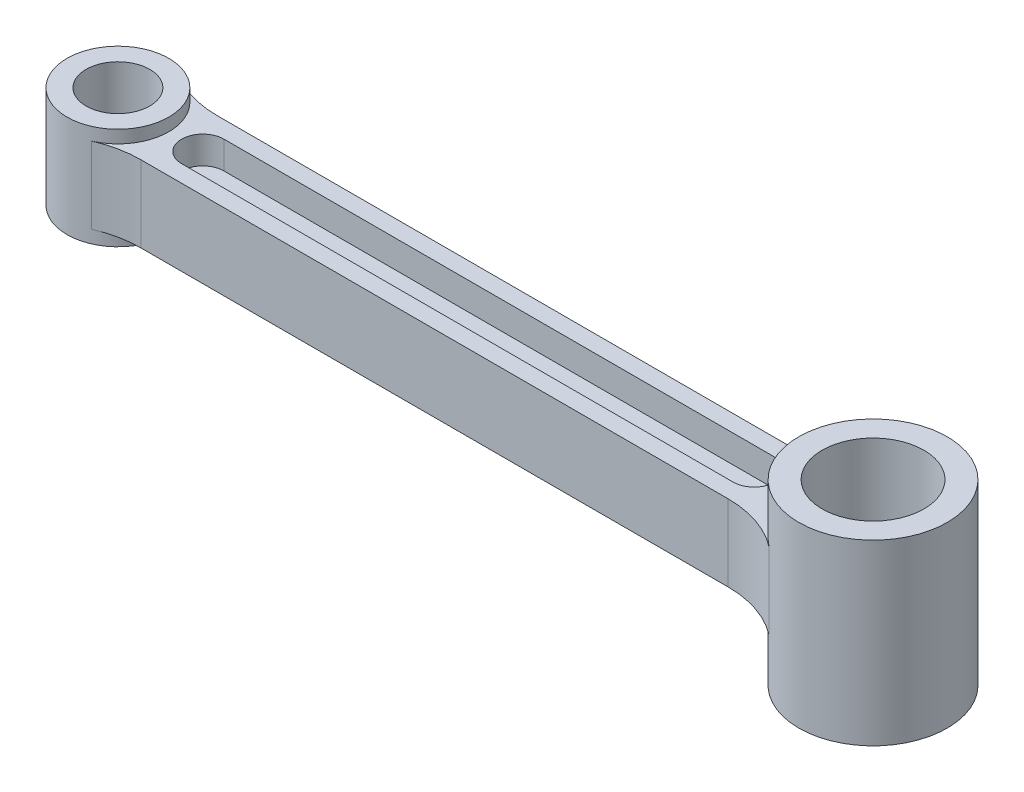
ISO-10303-21;
HEADER;
FILE_DESCRIPTION(('STEP AP214'),'2;1');
FILE_NAME('part.step','',(''),(''),'','','');
FILE_SCHEMA(('AUTOMOTIVE_DESIGN { 1 0 10303 214 1 1 1 1 }'));
ENDSEC;
DATA;
#1=APPLICATION_CONTEXT('core data for automotive mechanical design processes');
#2=APPLICATION_PROTOCOL_DEFINITION('international standard','automotive_design',2000,#1);
#3=PRODUCT_CONTEXT('',#1,'mechanical');
#4=PRODUCT('Part','Part','',(#3));
#5=PRODUCT_RELATED_PRODUCT_CATEGORY('part','',(#4));
#6=PRODUCT_DEFINITION_FORMATION('','',#4);
#7=PRODUCT_DEFINITION_CONTEXT('part definition',#1,'design');
#8=PRODUCT_DEFINITION('design','',#6,#7);
#9=PRODUCT_DEFINITION_SHAPE('','',#8);
#10=(LENGTH_UNIT() NAMED_UNIT(*) SI_UNIT(.MILLI.,.METRE.));
#11=(NAMED_UNIT(*) PLANE_ANGLE_UNIT() SI_UNIT($,.RADIAN.));
#12=(NAMED_UNIT(*) SI_UNIT($,.STERADIAN.) SOLID_ANGLE_UNIT());
#13=UNCERTAINTY_MEASURE_WITH_UNIT(LENGTH_MEASURE(1.E-05),#10,'distance_accuracy_value','');
#14=(GEOMETRIC_REPRESENTATION_CONTEXT(3) GLOBAL_UNCERTAINTY_ASSIGNED_CONTEXT((#13)) GLOBAL_UNIT_ASSIGNED_CONTEXT((#10,
#11,#12)) REPRESENTATION_CONTEXT('',''));
#15=CARTESIAN_POINT('',(0.,0.,0.));
#16=DIRECTION('',(0.,0.,1.));
#17=DIRECTION('',(1.,0.,0.));
#18=AXIS2_PLACEMENT_3D('',#15,#16,#17);
#19=CARTESIAN_POINT('',(-72.0684088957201,-9.,0.));
#20=DIRECTION('',(0.,1.,0.));
#21=DIRECTION('',(0.,0.,1.));
#22=AXIS2_PLACEMENT_3D('',#19,#20,#21);
#23=PLANE('',#22);
#24=CARTESIAN_POINT('',(178.,-9.,0.));
#25=DIRECTION('',(0.,1.,0.));
#26=DIRECTION('',(0.,0.,1.));
#27=AXIS2_PLACEMENT_3D('',#24,#25,#26);
#28=CIRCLE('',#27,17.5);
#29=CARTESIAN_POINT('',(167.388481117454,-9.,-13.9156626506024));
#30=VERTEX_POINT('',#29);
#31=CARTESIAN_POINT('',(167.388481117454,-9.,13.9156626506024));
#32=VERTEX_POINT('',#31);
#33=EDGE_CURVE('E232',#30,#32,#28,.T.);
#34=ORIENTED_EDGE('',*,*,#33,.T.);
#35=CARTESIAN_POINT('',(152.835540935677,-9.,33.));
#36=DIRECTION('',(0.,1.,0.));
#37=DIRECTION('',(0.,0.,1.));
#38=AXIS2_PLACEMENT_3D('',#35,#36,#37);
#39=CIRCLE('',#38,24.);
#40=CARTESIAN_POINT('',(152.835540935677,-9.,9.));
#41=VERTEX_POINT('',#40);
#42=EDGE_CURVE('E40',#32,#41,#39,.T.);
#43=ORIENTED_EDGE('',*,*,#42,.T.);
#44=DIRECTION('',(1.,0.,0.));
#45=VECTOR('',#44,1.);
#46=CARTESIAN_POINT('',(-72.0684088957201,-9.,9.));
#47=LINE('',#46,#45);
#48=CARTESIAN_POINT('',(14.3874945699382,-9.,9.));
#49=VERTEX_POINT('',#48);
#50=EDGE_CURVE('E239',#49,#41,#47,.T.);
#51=ORIENTED_EDGE('',*,*,#50,.F.);
#52=CARTESIAN_POINT('',(14.3874945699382,-9.,33.));
#53=DIRECTION('',(0.,1.,0.));
#54=DIRECTION('',(0.,0.,1.));
#55=AXIS2_PLACEMENT_3D('',#52,#53,#54);
#56=CIRCLE('',#55,24.);
#57=CARTESIAN_POINT('',(4.79583152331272,-9.,11.));
#58=VERTEX_POINT('',#57);
#59=EDGE_CURVE('E279',#49,#58,#56,.T.);
#60=ORIENTED_EDGE('',*,*,#59,.T.);
#61=CARTESIAN_POINT('',(0.,-9.,0.));
#62=DIRECTION('',(0.,1.,0.));
#63=DIRECTION('',(0.,0.,1.));
#64=AXIS2_PLACEMENT_3D('',#61,#62,#63);
#65=CIRCLE('',#64,12.);
#66=CARTESIAN_POINT('',(4.79583152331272,-9.,-11.));
#67=VERTEX_POINT('',#66);
#68=EDGE_CURVE('E237',#58,#67,#65,.T.);
#69=ORIENTED_EDGE('',*,*,#68,.T.);
#70=CARTESIAN_POINT('',(14.3874945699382,-9.,-33.));
#71=DIRECTION('',(0.,1.,0.));
#72=DIRECTION('',(0.,0.,1.));
#73=AXIS2_PLACEMENT_3D('',#70,#71,#72);
#74=CIRCLE('',#73,24.);
#75=CARTESIAN_POINT('',(14.3874945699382,-9.,-9.));
#76=VERTEX_POINT('',#75);
#77=EDGE_CURVE('E274',#67,#76,#74,.T.);
#78=ORIENTED_EDGE('',*,*,#77,.T.);
#79=DIRECTION('',(1.,0.,0.));
#80=VECTOR('',#79,1.);
#81=CARTESIAN_POINT('',(-72.0684088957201,-9.,-9.));
#82=LINE('',#81,#80);
#83=CARTESIAN_POINT('',(152.835540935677,-9.,-9.));
#84=VERTEX_POINT('',#83);
#85=EDGE_CURVE('E234',#76,#84,#82,.T.);
#86=ORIENTED_EDGE('',*,*,#85,.T.);
#87=CARTESIAN_POINT('',(152.835540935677,-9.,-33.));
#88=DIRECTION('',(0.,1.,0.));
#89=DIRECTION('',(0.,0.,1.));
#90=AXIS2_PLACEMENT_3D('',#87,#88,#89);
#91=CIRCLE('',#90,24.);
#92=EDGE_CURVE('E284',#84,#30,#91,.T.);
#93=ORIENTED_EDGE('',*,*,#92,.T.);
#94=EDGE_LOOP('',(#34,#43,#51,#60,#69,#78,#86,#93));
#95=FACE_BOUND('',#94,.T.);
#96=CARTESIAN_POINT('',(150.,-9.,0.));
#97=DIRECTION('',(0.,1.,0.));
#98=DIRECTION('',(0.,0.,1.));
#99=AXIS2_PLACEMENT_3D('',#96,#97,#98);
#100=CIRCLE('',#99,4.99999999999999);
#101=CARTESIAN_POINT('',(150.,-9.,4.99999999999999));
#102=VERTEX_POINT('',#101);
#103=CARTESIAN_POINT('',(150.,-9.,-4.99999999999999));
#104=VERTEX_POINT('',#103);
#105=EDGE_CURVE('E47',#102,#104,#100,.T.);
#106=ORIENTED_EDGE('',*,*,#105,.T.);
#107=DIRECTION('',(-1.,0.,0.));
#108=VECTOR('',#107,1.);
#109=CARTESIAN_POINT('',(150.,-9.,-4.99999999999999));
#110=LINE('',#109,#108);
#111=CARTESIAN_POINT('',(20.,-9.,-5.));
#112=VERTEX_POINT('',#111);
#113=EDGE_CURVE('E180',#104,#112,#110,.T.);
#114=ORIENTED_EDGE('',*,*,#113,.T.);
#115=CARTESIAN_POINT('',(20.,-9.,0.));
#116=DIRECTION('',(0.,1.,0.));
#117=DIRECTION('',(0.,0.,1.));
#118=AXIS2_PLACEMENT_3D('',#115,#116,#117);
#119=CIRCLE('',#118,5.);
#120=CARTESIAN_POINT('',(20.,-9.,5.00000000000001));
#121=VERTEX_POINT('',#120);
#122=EDGE_CURVE('E156',#112,#121,#119,.T.);
#123=ORIENTED_EDGE('',*,*,#122,.T.);
#124=DIRECTION('',(1.,0.,0.));
#125=VECTOR('',#124,1.);
#126=CARTESIAN_POINT('',(20.,-9.,5.00000000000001));
#127=LINE('',#126,#125);
#128=EDGE_CURVE('E151',#121,#102,#127,.T.);
#129=ORIENTED_EDGE('',*,*,#128,.T.);
#130=EDGE_LOOP('',(#106,#114,#123,#129));
#131=FACE_BOUND('',#130,.T.);
#132=ADVANCED_FACE('F32',(#95,#131),#23,.F.);
#133=CARTESIAN_POINT('',(-72.0684088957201,9.,-9.));
#134=DIRECTION('',(0.,0.,-1.));
#135=DIRECTION('',(-1.,0.,0.));
#136=AXIS2_PLACEMENT_3D('',#133,#134,#135);
#137=PLANE('',#136);
#138=ORIENTED_EDGE('',*,*,#85,.F.);
#139=DIRECTION('',(0.,-1.,0.));
#140=VECTOR('',#139,1.);
#141=CARTESIAN_POINT('',(14.3874945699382,9.,-9.));
#142=LINE('',#141,#140);
#143=CARTESIAN_POINT('',(14.3874945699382,9.,-9.));
#144=VERTEX_POINT('',#143);
#145=EDGE_CURVE('E261',#76,#144,#142,.F.);
#146=ORIENTED_EDGE('',*,*,#145,.T.);
#147=DIRECTION('',(1.,0.,0.));
#148=VECTOR('',#147,1.);
#149=CARTESIAN_POINT('',(-72.0684088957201,9.,-9.));
#150=LINE('',#149,#148);
#151=CARTESIAN_POINT('',(152.835540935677,9.,-9.));
#152=VERTEX_POINT('',#151);
#153=EDGE_CURVE('E244',#144,#152,#150,.T.);
#154=ORIENTED_EDGE('',*,*,#153,.T.);
#155=DIRECTION('',(0.,-1.,0.));
#156=VECTOR('',#155,1.);
#157=CARTESIAN_POINT('',(152.835540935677,9.,-9.));
#158=LINE('',#157,#156);
#159=EDGE_CURVE('E258',#152,#84,#158,.T.);
#160=ORIENTED_EDGE('',*,*,#159,.T.);
#161=EDGE_LOOP('',(#138,#146,#154,#160));
#162=FACE_BOUND('',#161,.T.);
#163=ADVANCED_FACE('F34',(#162),#137,.T.);
#164=CARTESIAN_POINT('',(-72.0684088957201,9.,9.));
#165=DIRECTION('',(0.,0.,-1.));
#166=DIRECTION('',(-1.,0.,0.));
#167=AXIS2_PLACEMENT_3D('',#164,#165,#166);
#168=PLANE('',#167);
#169=DIRECTION('',(1.,0.,0.));
#170=VECTOR('',#169,1.);
#171=CARTESIAN_POINT('',(-72.0684088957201,9.,9.));
#172=LINE('',#171,#170);
#173=CARTESIAN_POINT('',(14.3874945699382,9.,9.));
#174=VERTEX_POINT('',#173);
#175=CARTESIAN_POINT('',(152.835540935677,9.,9.));
#176=VERTEX_POINT('',#175);
#177=EDGE_CURVE('E249',#174,#176,#172,.T.);
#178=ORIENTED_EDGE('',*,*,#177,.F.);
#179=DIRECTION('',(0.,1.,0.));
#180=VECTOR('',#179,1.);
#181=CARTESIAN_POINT('',(14.3874945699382,-9.,9.));
#182=LINE('',#181,#180);
#183=EDGE_CURVE('E265',#174,#49,#182,.F.);
#184=ORIENTED_EDGE('',*,*,#183,.T.);
#185=ORIENTED_EDGE('',*,*,#50,.T.);
#186=DIRECTION('',(0.,1.,0.));
#187=VECTOR('',#186,1.);
#188=CARTESIAN_POINT('',(152.835540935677,9.,9.));
#189=LINE('',#188,#187);
#190=EDGE_CURVE('E263',#41,#176,#189,.T.);
#191=ORIENTED_EDGE('',*,*,#190,.T.);
#192=EDGE_LOOP('',(#178,#184,#185,#191));
#193=FACE_BOUND('',#192,.T.);
#194=ADVANCED_FACE('F297',(#193),#168,.F.);
#195=CARTESIAN_POINT('',(-72.0684088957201,9.,0.));
#196=DIRECTION('',(0.,1.,0.));
#197=DIRECTION('',(0.,0.,1.));
#198=AXIS2_PLACEMENT_3D('',#195,#196,#197);
#199=PLANE('',#198);
#200=CARTESIAN_POINT('',(150.,9.,0.));
#201=DIRECTION('',(0.,1.,0.));
#202=DIRECTION('',(0.,0.,1.));
#203=AXIS2_PLACEMENT_3D('',#200,#201,#202);
#204=CIRCLE('',#203,4.99999999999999);
#205=CARTESIAN_POINT('',(150.,9.,4.99999999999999));
#206=VERTEX_POINT('',#205);
#207=CARTESIAN_POINT('',(150.,9.,-4.99999999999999));
#208=VERTEX_POINT('',#207);
#209=EDGE_CURVE('E55',#206,#208,#204,.T.);
#210=ORIENTED_EDGE('',*,*,#209,.F.);
#211=DIRECTION('',(1.,0.,0.));
#212=VECTOR('',#211,1.);
#213=CARTESIAN_POINT('',(20.,9.,5.00000000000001));
#214=LINE('',#213,#212);
#215=CARTESIAN_POINT('',(20.,9.,5.00000000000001));
#216=VERTEX_POINT('',#215);
#217=EDGE_CURVE('E197',#216,#206,#214,.T.);
#218=ORIENTED_EDGE('',*,*,#217,.F.);
#219=CARTESIAN_POINT('',(20.,9.,0.));
#220=DIRECTION('',(0.,1.,0.));
#221=DIRECTION('',(0.,0.,1.));
#222=AXIS2_PLACEMENT_3D('',#219,#220,#221);
#223=CIRCLE('',#222,5.);
#224=CARTESIAN_POINT('',(20.,9.,-5.));
#225=VERTEX_POINT('',#224);
#226=EDGE_CURVE('E194',#225,#216,#223,.T.);
#227=ORIENTED_EDGE('',*,*,#226,.F.);
#228=DIRECTION('',(-1.,0.,0.));
#229=VECTOR('',#228,1.);
#230=CARTESIAN_POINT('',(150.,9.,-4.99999999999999));
#231=LINE('',#230,#229);
#232=EDGE_CURVE('E171',#208,#225,#231,.T.);
#233=ORIENTED_EDGE('',*,*,#232,.F.);
#234=EDGE_LOOP('',(#210,#218,#227,#233));
#235=FACE_BOUND('',#234,.T.);
#236=CARTESIAN_POINT('',(178.,9.,0.));
#237=DIRECTION('',(0.,1.,0.));
#238=DIRECTION('',(0.,0.,1.));
#239=AXIS2_PLACEMENT_3D('',#236,#237,#238);
#240=CIRCLE('',#239,17.5);
#241=CARTESIAN_POINT('',(167.388481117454,9.,-13.9156626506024));
#242=VERTEX_POINT('',#241);
#243=CARTESIAN_POINT('',(167.388481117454,9.,13.9156626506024));
#244=VERTEX_POINT('',#243);
#245=EDGE_CURVE('E242',#242,#244,#240,.T.);
#246=ORIENTED_EDGE('',*,*,#245,.F.);
#247=CARTESIAN_POINT('',(152.835540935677,9.,-33.));
#248=DIRECTION('',(0.,1.,0.));
#249=DIRECTION('',(0.,0.,1.));
#250=AXIS2_PLACEMENT_3D('',#247,#248,#249);
#251=CIRCLE('',#250,24.);
#252=EDGE_CURVE('E287',#242,#152,#251,.F.);
#253=ORIENTED_EDGE('',*,*,#252,.T.);
#254=ORIENTED_EDGE('',*,*,#153,.F.);
#255=CARTESIAN_POINT('',(14.3874945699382,9.,-33.));
#256=DIRECTION('',(0.,1.,0.));
#257=DIRECTION('',(0.,0.,1.));
#258=AXIS2_PLACEMENT_3D('',#255,#256,#257);
#259=CIRCLE('',#258,24.);
#260=CARTESIAN_POINT('',(4.79583152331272,9.,-11.));
#261=VERTEX_POINT('',#260);
#262=EDGE_CURVE('E276',#144,#261,#259,.F.);
#263=ORIENTED_EDGE('',*,*,#262,.T.);
#264=CARTESIAN_POINT('',(0.,9.,0.));
#265=DIRECTION('',(0.,1.,0.));
#266=DIRECTION('',(0.,0.,1.));
#267=AXIS2_PLACEMENT_3D('',#264,#265,#266);
#268=CIRCLE('',#267,12.);
#269=CARTESIAN_POINT('',(4.79583152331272,9.,11.));
#270=VERTEX_POINT('',#269);
#271=EDGE_CURVE('E247',#270,#261,#268,.T.);
#272=ORIENTED_EDGE('',*,*,#271,.F.);
#273=CARTESIAN_POINT('',(14.3874945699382,9.,33.));
#274=DIRECTION('',(0.,1.,0.));
#275=DIRECTION('',(0.,0.,1.));
#276=AXIS2_PLACEMENT_3D('',#273,#274,#275);
#277=CIRCLE('',#276,24.);
#278=EDGE_CURVE('E282',#270,#174,#277,.F.);
#279=ORIENTED_EDGE('',*,*,#278,.T.);
#280=ORIENTED_EDGE('',*,*,#177,.T.);
#281=CARTESIAN_POINT('',(152.835540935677,9.,33.));
#282=DIRECTION('',(0.,1.,0.));
#283=DIRECTION('',(0.,0.,1.));
#284=AXIS2_PLACEMENT_3D('',#281,#282,#283);
#285=CIRCLE('',#284,24.);
#286=EDGE_CURVE('E11',#176,#244,#285,.F.);
#287=ORIENTED_EDGE('',*,*,#286,.T.);
#288=EDGE_LOOP('',(#246,#253,#254,#263,#272,#279,#280,#287));
#289=FACE_BOUND('',#288,.T.);
#290=ADVANCED_FACE('F302',(#235,#289),#199,.T.);
#291=CARTESIAN_POINT('',(178.,21.,0.));
#292=DIRECTION('',(0.,-1.,0.));
#293=DIRECTION('',(0.,0.,-1.));
#294=AXIS2_PLACEMENT_3D('',#291,#292,#293);
#295=CYLINDRICAL_SURFACE('',#294,12.);
#296=CARTESIAN_POINT('',(178.,21.,0.));
#297=DIRECTION('',(0.,1.,0.));
#298=DIRECTION('',(0.,0.,1.));
#299=AXIS2_PLACEMENT_3D('',#296,#297,#298);
#300=CIRCLE('',#299,12.);
#301=CARTESIAN_POINT('',(178.,21.,-12.));
#302=VERTEX_POINT('',#301);
#303=EDGE_CURVE('E226',#302,#302,#300,.T.);
#304=CARTESIAN_POINT('',(178.,-21.,0.));
#305=DIRECTION('',(0.,1.,0.));
#306=DIRECTION('',(0.,0.,1.));
#307=AXIS2_PLACEMENT_3D('',#304,#305,#306);
#308=CIRCLE('',#307,12.);
#309=CARTESIAN_POINT('',(178.,-21.,-12.));
#310=VERTEX_POINT('',#309);
#311=EDGE_CURVE('E220',#310,#310,#308,.T.);
#312=CARTESIAN_POINT('',(178.,21.,-12.));
#313=CARTESIAN_POINT('',(178.,20.5625,-12.));
#314=CARTESIAN_POINT('',(178.,20.125,-12.));
#315=CARTESIAN_POINT('',(178.,19.25,-12.));
#316=CARTESIAN_POINT('',(178.,18.8125,-12.));
#317=CARTESIAN_POINT('',(178.,17.9375,-12.));
#318=CARTESIAN_POINT('',(178.,17.5,-12.));
#319=CARTESIAN_POINT('',(178.,16.625,-12.));
#320=CARTESIAN_POINT('',(178.,16.1875,-12.));
#321=CARTESIAN_POINT('',(178.,15.3125,-12.));
#322=CARTESIAN_POINT('',(178.,14.875,-12.));
#323=CARTESIAN_POINT('',(178.,14.,-12.));
#324=CARTESIAN_POINT('',(178.,13.5625,-12.));
#325=CARTESIAN_POINT('',(178.,12.6875,-12.));
#326=CARTESIAN_POINT('',(178.,12.25,-12.));
#327=CARTESIAN_POINT('',(178.,11.375,-12.));
#328=CARTESIAN_POINT('',(178.,10.9375,-12.));
#329=CARTESIAN_POINT('',(178.,10.0625,-12.));
#330=CARTESIAN_POINT('',(178.,9.625,-12.));
#331=CARTESIAN_POINT('',(178.,8.75,-12.));
#332=CARTESIAN_POINT('',(178.,8.3125,-12.));
#333=CARTESIAN_POINT('',(178.,7.4375,-12.));
#334=CARTESIAN_POINT('',(178.,7.,-12.));
#335=CARTESIAN_POINT('',(178.,6.125,-12.));
#336=CARTESIAN_POINT('',(178.,5.6875,-12.));
#337=CARTESIAN_POINT('',(178.,4.8125,-12.));
#338=CARTESIAN_POINT('',(178.,4.375,-12.));
#339=CARTESIAN_POINT('',(178.,3.5,-12.));
#340=CARTESIAN_POINT('',(178.,3.0625,-12.));
#341=CARTESIAN_POINT('',(178.,2.1875,-12.));
#342=CARTESIAN_POINT('',(178.,1.75,-12.));
#343=CARTESIAN_POINT('',(178.,0.874999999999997,-12.));
#344=CARTESIAN_POINT('',(178.,0.437499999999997,-12.));
#345=CARTESIAN_POINT('',(178.,-0.437500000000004,-12.));
#346=CARTESIAN_POINT('',(178.,-0.875000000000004,-12.));
#347=CARTESIAN_POINT('',(178.,-1.75000000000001,-12.));
#348=CARTESIAN_POINT('',(178.,-2.18750000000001,-12.));
#349=CARTESIAN_POINT('',(178.,-3.0625,-12.));
#350=CARTESIAN_POINT('',(178.,-3.5,-12.));
#351=CARTESIAN_POINT('',(178.,-4.375,-12.));
#352=CARTESIAN_POINT('',(178.,-4.8125,-12.));
#353=CARTESIAN_POINT('',(178.,-5.68750000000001,-12.));
#354=CARTESIAN_POINT('',(178.,-6.12500000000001,-12.));
#355=CARTESIAN_POINT('',(178.,-7.00000000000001,-12.));
#356=CARTESIAN_POINT('',(178.,-7.4375,-12.));
#357=CARTESIAN_POINT('',(178.,-8.3125,-12.));
#358=CARTESIAN_POINT('',(178.,-8.75,-12.));
#359=CARTESIAN_POINT('',(178.,-9.625,-12.));
#360=CARTESIAN_POINT('',(178.,-10.0625,-12.));
#361=CARTESIAN_POINT('',(178.,-10.9375,-12.));
#362=CARTESIAN_POINT('',(178.,-11.375,-12.));
#363=CARTESIAN_POINT('',(178.,-12.25,-12.));
#364=CARTESIAN_POINT('',(178.,-12.6875,-12.));
#365=CARTESIAN_POINT('',(178.,-13.5625,-12.));
#366=CARTESIAN_POINT('',(178.,-14.,-12.));
#367=CARTESIAN_POINT('',(178.,-14.875,-12.));
#368=CARTESIAN_POINT('',(178.,-15.3125,-12.));
#369=CARTESIAN_POINT('',(178.,-16.1875,-12.));
#370=CARTESIAN_POINT('',(178.,-16.625,-12.));
#371=CARTESIAN_POINT('',(178.,-17.5,-12.));
#372=CARTESIAN_POINT('',(178.,-17.9375,-12.));
#373=CARTESIAN_POINT('',(178.,-18.8125,-12.));
#374=CARTESIAN_POINT('',(178.,-19.25,-12.));
#375=CARTESIAN_POINT('',(178.,-20.125,-12.));
#376=CARTESIAN_POINT('',(178.,-20.5625,-12.));
#377=CARTESIAN_POINT('',(178.,-21.,-12.));
#378=B_SPLINE_CURVE_WITH_KNOTS('',3,(#312,#313,#314,#315,#316,#317,#318,#319,#320,#321,#322,
#323,#324,#325,#326,#327,#328,#329,#330,#331,#332,#333,#334,#335,#336,#337,#338,#339,#340,#341,
#342,#343,#344,#345,#346,#347,#348,#349,#350,#351,#352,#353,#354,#355,#356,#357,#358,#359,#360,
#361,#362,#363,#364,#365,#366,#367,#368,#369,#370,#371,#372,#373,#374,#375,#376,#377),
.UNSPECIFIED.,.F.,.F.,(4,2,2,2,2,2,2,2,2,2,2,2,2,2,2,2,2,2,2,2,2,2,2,2,2,2,2,2,2,2,2,2,4),(0.,
1.3125,2.625,3.9375,5.25,6.5625,7.875,9.1875,10.5,11.8125,13.125,14.4375,15.75,17.0625,18.375,
19.6875,21.,22.3125,23.625,24.9375,26.25,27.5625,28.875,30.1875,31.5,32.8125,34.125,35.4375,
36.75,38.0625,39.375,40.6875,42.),.UNSPECIFIED.);
#379=EDGE_CURVE('BSEAM329',#302,#310,#378,.T.);
#380=ORIENTED_EDGE('',*,*,#303,.T.);
#381=ORIENTED_EDGE('',*,*,#311,.F.);
#382=ORIENTED_EDGE('',*,*,#379,.T.);
#383=ORIENTED_EDGE('',*,*,#379,.F.);
#384=EDGE_LOOP('',(#380,#382,#381,#383));
#385=FACE_BOUND('',#384,.T.);
#386=ADVANCED_FACE('F329',(#385),#295,.F.);
#387=CARTESIAN_POINT('',(178.,21.,0.));
#388=DIRECTION('',(0.,-1.,0.));
#389=DIRECTION('',(0.,0.,-1.));
#390=AXIS2_PLACEMENT_3D('',#387,#388,#389);
#391=CYLINDRICAL_SURFACE('',#390,17.5);
#392=ORIENTED_EDGE('',*,*,#33,.F.);
#393=DIRECTION('',(0.,-1.,0.));
#394=VECTOR('',#393,1.);
#395=CARTESIAN_POINT('',(167.388481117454,21.,-13.9156626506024));
#396=LINE('',#395,#394);
#397=EDGE_CURVE('E271',#30,#242,#396,.F.);
#398=ORIENTED_EDGE('',*,*,#397,.T.);
#399=ORIENTED_EDGE('',*,*,#245,.T.);
#400=DIRECTION('',(0.,-1.,0.));
#401=VECTOR('',#400,1.);
#402=CARTESIAN_POINT('',(167.388481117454,21.,13.9156626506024));
#403=LINE('',#402,#401);
#404=EDGE_CURVE('E268',#244,#32,#403,.T.);
#405=ORIENTED_EDGE('',*,*,#404,.T.);
#406=EDGE_LOOP('',(#392,#398,#399,#405));
#407=FACE_BOUND('',#406,.T.);
#408=CARTESIAN_POINT('',(178.,21.,0.));
#409=DIRECTION('',(0.,1.,0.));
#410=DIRECTION('',(0.,0.,1.));
#411=AXIS2_PLACEMENT_3D('',#408,#409,#410);
#412=CIRCLE('',#411,17.5);
#413=CARTESIAN_POINT('',(178.,21.,17.5));
#414=VERTEX_POINT('',#413);
#415=EDGE_CURVE('E229',#414,#414,#412,.T.);
#416=ORIENTED_EDGE('',*,*,#415,.F.);
#417=EDGE_LOOP('',(#416));
#418=FACE_BOUND('',#417,.T.);
#419=CARTESIAN_POINT('',(178.,-21.,0.));
#420=DIRECTION('',(0.,1.,0.));
#421=DIRECTION('',(0.,0.,1.));
#422=AXIS2_PLACEMENT_3D('',#419,#420,#421);
#423=CIRCLE('',#422,17.5);
#424=CARTESIAN_POINT('',(178.,-21.,17.5));
#425=VERTEX_POINT('',#424);
#426=EDGE_CURVE('E223',#425,#425,#423,.T.);
#427=ORIENTED_EDGE('',*,*,#426,.T.);
#428=EDGE_LOOP('',(#427));
#429=FACE_BOUND('',#428,.T.);
#430=ADVANCED_FACE('F325',(#407,#418,#429),#391,.T.);
#431=CARTESIAN_POINT('',(-72.0684088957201,21.,0.));
#432=DIRECTION('',(0.,1.,0.));
#433=DIRECTION('',(0.,0.,1.));
#434=AXIS2_PLACEMENT_3D('',#431,#432,#433);
#435=PLANE('',#434);
#436=ORIENTED_EDGE('',*,*,#303,.F.);
#437=EDGE_LOOP('',(#436));
#438=FACE_BOUND('',#437,.T.);
#439=ORIENTED_EDGE('',*,*,#415,.T.);
#440=EDGE_LOOP('',(#439));
#441=FACE_BOUND('',#440,.T.);
#442=ADVANCED_FACE('F328',(#438,#441),#435,.T.);
#443=CARTESIAN_POINT('',(-72.0684088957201,-21.,0.));
#444=DIRECTION('',(0.,1.,0.));
#445=DIRECTION('',(0.,0.,1.));
#446=AXIS2_PLACEMENT_3D('',#443,#444,#445);
#447=PLANE('',#446);
#448=ORIENTED_EDGE('',*,*,#311,.T.);
#449=EDGE_LOOP('',(#448));
#450=FACE_BOUND('',#449,.T.);
#451=ORIENTED_EDGE('',*,*,#426,.F.);
#452=EDGE_LOOP('',(#451));
#453=FACE_BOUND('',#452,.T.);
#454=ADVANCED_FACE('F335',(#450,#453),#447,.F.);
#455=CARTESIAN_POINT('',(0.,12.,0.));
#456=DIRECTION('',(0.,-1.,0.));
#457=DIRECTION('',(0.,0.,-1.));
#458=AXIS2_PLACEMENT_3D('',#455,#456,#457);
#459=CYLINDRICAL_SURFACE('',#458,7.5);
#460=CARTESIAN_POINT('',(0.,12.,0.));
#461=DIRECTION('',(0.,1.,0.));
#462=DIRECTION('',(0.,0.,1.));
#463=AXIS2_PLACEMENT_3D('',#460,#461,#462);
#464=CIRCLE('',#463,7.5);
#465=CARTESIAN_POINT('',(0.,12.,7.5));
#466=VERTEX_POINT('',#465);
#467=EDGE_CURVE('E214',#466,#466,#464,.T.);
#468=ORIENTED_EDGE('',*,*,#467,.T.);
#469=EDGE_LOOP('',(#468));
#470=FACE_BOUND('',#469,.T.);
#471=CARTESIAN_POINT('',(0.,-12.,0.));
#472=DIRECTION('',(0.,1.,0.));
#473=DIRECTION('',(0.,0.,1.));
#474=AXIS2_PLACEMENT_3D('',#471,#472,#473);
#475=CIRCLE('',#474,7.5);
#476=CARTESIAN_POINT('',(0.,-12.,7.5));
#477=VERTEX_POINT('',#476);
#478=EDGE_CURVE('E208',#477,#477,#475,.T.);
#479=ORIENTED_EDGE('',*,*,#478,.F.);
#480=EDGE_LOOP('',(#479));
#481=FACE_BOUND('',#480,.T.);
#482=ADVANCED_FACE('F337',(#470,#481),#459,.F.);
#483=CARTESIAN_POINT('',(0.,12.,0.));
#484=DIRECTION('',(0.,-1.,0.));
#485=DIRECTION('',(0.,0.,-1.));
#486=AXIS2_PLACEMENT_3D('',#483,#484,#485);
#487=CYLINDRICAL_SURFACE('',#486,12.);
#488=DIRECTION('',(0.,-1.,0.));
#489=VECTOR('',#488,1.);
#490=CARTESIAN_POINT('',(4.79583152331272,12.,-11.));
#491=LINE('',#490,#489);
#492=EDGE_CURVE('E255',#261,#67,#491,.T.);
#493=ORIENTED_EDGE('',*,*,#492,.T.);
#494=ORIENTED_EDGE('',*,*,#68,.F.);
#495=DIRECTION('',(0.,-1.,0.));
#496=VECTOR('',#495,1.);
#497=CARTESIAN_POINT('',(4.79583152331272,12.,11.));
#498=LINE('',#497,#496);
#499=EDGE_CURVE('E252',#58,#270,#498,.F.);
#500=ORIENTED_EDGE('',*,*,#499,.T.);
#501=ORIENTED_EDGE('',*,*,#271,.T.);
#502=EDGE_LOOP('',(#493,#494,#500,#501));
#503=FACE_BOUND('',#502,.T.);
#504=CARTESIAN_POINT('',(0.,12.,0.));
#505=DIRECTION('',(0.,1.,0.));
#506=DIRECTION('',(0.,0.,1.));
#507=AXIS2_PLACEMENT_3D('',#504,#505,#506);
#508=CIRCLE('',#507,12.);
#509=CARTESIAN_POINT('',(0.,12.,12.));
#510=VERTEX_POINT('',#509);
#511=EDGE_CURVE('E217',#510,#510,#508,.T.);
#512=ORIENTED_EDGE('',*,*,#511,.F.);
#513=EDGE_LOOP('',(#512));
#514=FACE_BOUND('',#513,.T.);
#515=CARTESIAN_POINT('',(0.,-12.,0.));
#516=DIRECTION('',(0.,1.,0.));
#517=DIRECTION('',(0.,0.,1.));
#518=AXIS2_PLACEMENT_3D('',#515,#516,#517);
#519=CIRCLE('',#518,12.);
#520=CARTESIAN_POINT('',(0.,-12.,12.));
#521=VERTEX_POINT('',#520);
#522=EDGE_CURVE('E211',#521,#521,#519,.T.);
#523=ORIENTED_EDGE('',*,*,#522,.T.);
#524=EDGE_LOOP('',(#523));
#525=FACE_BOUND('',#524,.T.);
#526=ADVANCED_FACE('F315',(#503,#514,#525),#487,.T.);
#527=CARTESIAN_POINT('',(-72.0684088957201,12.,0.));
#528=DIRECTION('',(0.,1.,0.));
#529=DIRECTION('',(0.,0.,1.));
#530=AXIS2_PLACEMENT_3D('',#527,#528,#529);
#531=PLANE('',#530);
#532=ORIENTED_EDGE('',*,*,#467,.F.);
#533=EDGE_LOOP('',(#532));
#534=FACE_BOUND('',#533,.T.);
#535=ORIENTED_EDGE('',*,*,#511,.T.);
#536=EDGE_LOOP('',(#535));
#537=FACE_BOUND('',#536,.T.);
#538=ADVANCED_FACE('F400',(#534,#537),#531,.T.);
#539=CARTESIAN_POINT('',(-72.0684088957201,-12.,0.));
#540=DIRECTION('',(0.,1.,0.));
#541=DIRECTION('',(0.,0.,1.));
#542=AXIS2_PLACEMENT_3D('',#539,#540,#541);
#543=PLANE('',#542);
#544=ORIENTED_EDGE('',*,*,#478,.T.);
#545=EDGE_LOOP('',(#544));
#546=FACE_BOUND('',#545,.T.);
#547=ORIENTED_EDGE('',*,*,#522,.F.);
#548=EDGE_LOOP('',(#547));
#549=FACE_BOUND('',#548,.T.);
#550=ADVANCED_FACE('F405',(#546,#549),#543,.F.);
#551=CARTESIAN_POINT('',(14.3874945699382,12.,-33.));
#552=DIRECTION('',(0.,-1.,0.));
#553=DIRECTION('',(0.,0.,-1.));
#554=AXIS2_PLACEMENT_3D('',#551,#552,#553);
#555=CYLINDRICAL_SURFACE('',#554,24.);
#556=ORIENTED_EDGE('',*,*,#262,.F.);
#557=ORIENTED_EDGE('',*,*,#145,.F.);
#558=ORIENTED_EDGE('',*,*,#77,.F.);
#559=ORIENTED_EDGE('',*,*,#492,.F.);
#560=EDGE_LOOP('',(#556,#557,#558,#559));
#561=FACE_BOUND('',#560,.T.);
#562=ADVANCED_FACE('F314',(#561),#555,.F.);
#563=CARTESIAN_POINT('',(14.3874945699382,12.,33.));
#564=DIRECTION('',(0.,-1.,0.));
#565=DIRECTION('',(0.,0.,-1.));
#566=AXIS2_PLACEMENT_3D('',#563,#564,#565);
#567=CYLINDRICAL_SURFACE('',#566,24.);
#568=ORIENTED_EDGE('',*,*,#278,.F.);
#569=ORIENTED_EDGE('',*,*,#499,.F.);
#570=ORIENTED_EDGE('',*,*,#59,.F.);
#571=ORIENTED_EDGE('',*,*,#183,.F.);
#572=EDGE_LOOP('',(#568,#569,#570,#571));
#573=FACE_BOUND('',#572,.T.);
#574=ADVANCED_FACE('F305',(#573),#567,.F.);
#575=CARTESIAN_POINT('',(152.835540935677,21.,-33.));
#576=DIRECTION('',(0.,-1.,0.));
#577=DIRECTION('',(0.,0.,-1.));
#578=AXIS2_PLACEMENT_3D('',#575,#576,#577);
#579=CYLINDRICAL_SURFACE('',#578,24.);
#580=ORIENTED_EDGE('',*,*,#252,.F.);
#581=ORIENTED_EDGE('',*,*,#397,.F.);
#582=ORIENTED_EDGE('',*,*,#92,.F.);
#583=ORIENTED_EDGE('',*,*,#159,.F.);
#584=EDGE_LOOP('',(#580,#581,#582,#583));
#585=FACE_BOUND('',#584,.T.);
#586=ADVANCED_FACE('F322',(#585),#579,.F.);
#587=CARTESIAN_POINT('',(152.835540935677,21.,33.));
#588=DIRECTION('',(0.,-1.,0.));
#589=DIRECTION('',(0.,0.,-1.));
#590=AXIS2_PLACEMENT_3D('',#587,#588,#589);
#591=CYLINDRICAL_SURFACE('',#590,24.);
#592=ORIENTED_EDGE('',*,*,#286,.F.);
#593=ORIENTED_EDGE('',*,*,#190,.F.);
#594=ORIENTED_EDGE('',*,*,#42,.F.);
#595=ORIENTED_EDGE('',*,*,#404,.F.);
#596=EDGE_LOOP('',(#592,#593,#594,#595));
#597=FACE_BOUND('',#596,.T.);
#598=ADVANCED_FACE('F300',(#597),#591,.F.);
#599=CARTESIAN_POINT('',(150.,-140.356688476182,0.));
#600=DIRECTION('',(0.,1.,0.));
#601=DIRECTION('',(0.,0.,1.));
#602=AXIS2_PLACEMENT_3D('',#599,#600,#601);
#603=CYLINDRICAL_SURFACE('',#602,4.99999999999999);
#604=CARTESIAN_POINT('',(150.,2.5,0.));
#605=DIRECTION('',(0.,1.,0.));
#606=DIRECTION('',(0.,0.,1.));
#607=AXIS2_PLACEMENT_3D('',#604,#605,#606);
#608=CIRCLE('',#607,4.99999999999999);
#609=CARTESIAN_POINT('',(150.,2.5,-4.99999999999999));
#610=VERTEX_POINT('',#609);
#611=CARTESIAN_POINT('',(150.,2.5,4.99999999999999));
#612=VERTEX_POINT('',#611);
#613=EDGE_CURVE('E189',#610,#612,#608,.F.);
#614=ORIENTED_EDGE('',*,*,#613,.T.);
#615=DIRECTION('',(0.,1.,0.));
#616=VECTOR('',#615,1.);
#617=CARTESIAN_POINT('',(150.,-140.356688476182,4.99999999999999));
#618=LINE('',#617,#616);
#619=EDGE_CURVE('E187',#612,#206,#618,.T.);
#620=ORIENTED_EDGE('',*,*,#619,.T.);
#621=ORIENTED_EDGE('',*,*,#209,.T.);
#622=DIRECTION('',(0.,1.,0.));
#623=VECTOR('',#622,1.);
#624=CARTESIAN_POINT('',(150.,-140.356688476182,-4.99999999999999));
#625=LINE('',#624,#623);
#626=EDGE_CURVE('E200',#610,#208,#625,.T.);
#627=ORIENTED_EDGE('',*,*,#626,.F.);
#628=EDGE_LOOP('',(#614,#620,#621,#627));
#629=FACE_BOUND('',#628,.T.);
#630=ADVANCED_FACE('F452',(#629),#603,.F.);
#631=CARTESIAN_POINT('',(20.,-140.356688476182,5.00000000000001));
#632=DIRECTION('',(0.,0.,1.));
#633=DIRECTION('',(1.,0.,0.));
#634=AXIS2_PLACEMENT_3D('',#631,#632,#633);
#635=PLANE('',#634);
#636=DIRECTION('',(-1.,0.,0.));
#637=VECTOR('',#636,1.);
#638=CARTESIAN_POINT('',(20.,2.5,5.00000000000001));
#639=LINE('',#638,#637);
#640=CARTESIAN_POINT('',(20.,2.5,5.));
#641=VERTEX_POINT('',#640);
#642=EDGE_CURVE('E186',#612,#641,#639,.T.);
#643=ORIENTED_EDGE('',*,*,#642,.T.);
#644=DIRECTION('',(0.,1.,0.));
#645=VECTOR('',#644,1.);
#646=CARTESIAN_POINT('',(20.,-140.356688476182,5.00000000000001));
#647=LINE('',#646,#645);
#648=EDGE_CURVE('E202',#641,#216,#647,.T.);
#649=ORIENTED_EDGE('',*,*,#648,.T.);
#650=ORIENTED_EDGE('',*,*,#217,.T.);
#651=ORIENTED_EDGE('',*,*,#619,.F.);
#652=EDGE_LOOP('',(#643,#649,#650,#651));
#653=FACE_BOUND('',#652,.T.);
#654=ADVANCED_FACE('F458',(#653),#635,.F.);
#655=CARTESIAN_POINT('',(20.,-140.356688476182,0.));
#656=DIRECTION('',(0.,1.,0.));
#657=DIRECTION('',(0.,0.,1.));
#658=AXIS2_PLACEMENT_3D('',#655,#656,#657);
#659=CYLINDRICAL_SURFACE('',#658,5.);
#660=CARTESIAN_POINT('',(20.,2.5,0.));
#661=DIRECTION('',(0.,1.,0.));
#662=DIRECTION('',(0.,0.,1.));
#663=AXIS2_PLACEMENT_3D('',#660,#661,#662);
#664=CIRCLE('',#663,5.);
#665=CARTESIAN_POINT('',(20.,2.5,-5.));
#666=VERTEX_POINT('',#665);
#667=EDGE_CURVE('E184',#641,#666,#664,.F.);
#668=ORIENTED_EDGE('',*,*,#667,.T.);
#669=DIRECTION('',(0.,1.,0.));
#670=VECTOR('',#669,1.);
#671=CARTESIAN_POINT('',(20.,-140.356688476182,-5.));
#672=LINE('',#671,#670);
#673=EDGE_CURVE('E204',#666,#225,#672,.T.);
#674=ORIENTED_EDGE('',*,*,#673,.T.);
#675=ORIENTED_EDGE('',*,*,#226,.T.);
#676=ORIENTED_EDGE('',*,*,#648,.F.);
#677=EDGE_LOOP('',(#668,#674,#675,#676));
#678=FACE_BOUND('',#677,.T.);
#679=ADVANCED_FACE('F465',(#678),#659,.F.);
#680=CARTESIAN_POINT('',(150.,-140.356688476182,-4.99999999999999));
#681=DIRECTION('',(0.,0.,-1.));
#682=DIRECTION('',(-1.,0.,0.));
#683=AXIS2_PLACEMENT_3D('',#680,#681,#682);
#684=PLANE('',#683);
#685=DIRECTION('',(1.,0.,0.));
#686=VECTOR('',#685,1.);
#687=CARTESIAN_POINT('',(150.,2.5,-4.99999999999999));
#688=LINE('',#687,#686);
#689=EDGE_CURVE('E190',#666,#610,#688,.T.);
#690=ORIENTED_EDGE('',*,*,#689,.T.);
#691=ORIENTED_EDGE('',*,*,#626,.T.);
#692=ORIENTED_EDGE('',*,*,#232,.T.);
#693=ORIENTED_EDGE('',*,*,#673,.F.);
#694=EDGE_LOOP('',(#690,#691,#692,#693));
#695=FACE_BOUND('',#694,.T.);
#696=ADVANCED_FACE('F473',(#695),#684,.F.);
#697=CARTESIAN_POINT('',(0.,2.5,0.));
#698=DIRECTION('',(0.,1.,0.));
#699=DIRECTION('',(0.,0.,1.));
#700=AXIS2_PLACEMENT_3D('',#697,#698,#699);
#701=PLANE('',#700);
#702=ORIENTED_EDGE('',*,*,#613,.F.);
#703=ORIENTED_EDGE('',*,*,#689,.F.);
#704=ORIENTED_EDGE('',*,*,#667,.F.);
#705=ORIENTED_EDGE('',*,*,#642,.F.);
#706=EDGE_LOOP('',(#702,#703,#704,#705));
#707=FACE_BOUND('',#706,.T.);
#708=ADVANCED_FACE('F481',(#707),#701,.T.);
#709=CARTESIAN_POINT('',(150.,140.356688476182,0.));
#710=DIRECTION('',(0.,-1.,0.));
#711=DIRECTION('',(0.,0.,-1.));
#712=AXIS2_PLACEMENT_3D('',#709,#710,#711);
#713=CYLINDRICAL_SURFACE('',#712,4.99999999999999);
#714=CARTESIAN_POINT('',(150.,-2.5,0.));
#715=DIRECTION('',(0.,1.,0.));
#716=DIRECTION('',(0.,0.,1.));
#717=AXIS2_PLACEMENT_3D('',#714,#715,#716);
#718=CIRCLE('',#717,4.99999999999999);
#719=CARTESIAN_POINT('',(150.,-2.5,4.99999999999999));
#720=VERTEX_POINT('',#719);
#721=CARTESIAN_POINT('',(150.,-2.5,-4.99999999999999));
#722=VERTEX_POINT('',#721);
#723=EDGE_CURVE('E164',#720,#722,#718,.T.);
#724=ORIENTED_EDGE('',*,*,#723,.T.);
#725=DIRECTION('',(0.,-1.,0.));
#726=VECTOR('',#725,1.);
#727=CARTESIAN_POINT('',(150.,140.356688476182,-4.99999999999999));
#728=LINE('',#727,#726);
#729=EDGE_CURVE('E178',#722,#104,#728,.T.);
#730=ORIENTED_EDGE('',*,*,#729,.T.);
#731=ORIENTED_EDGE('',*,*,#105,.F.);
#732=DIRECTION('',(0.,-1.,0.));
#733=VECTOR('',#732,1.);
#734=CARTESIAN_POINT('',(150.,140.356688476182,4.99999999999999));
#735=LINE('',#734,#733);
#736=EDGE_CURVE('E182',#720,#102,#735,.T.);
#737=ORIENTED_EDGE('',*,*,#736,.F.);
#738=EDGE_LOOP('',(#724,#730,#731,#737));
#739=FACE_BOUND('',#738,.T.);
#740=ADVANCED_FACE('F489',(#739),#713,.F.);
#741=CARTESIAN_POINT('',(150.,140.356688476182,-4.99999999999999));
#742=DIRECTION('',(0.,0.,1.));
#743=DIRECTION('',(1.,0.,0.));
#744=AXIS2_PLACEMENT_3D('',#741,#742,#743);
#745=PLANE('',#744);
#746=DIRECTION('',(-1.,0.,0.));
#747=VECTOR('',#746,1.);
#748=CARTESIAN_POINT('',(150.,-2.5,-4.99999999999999));
#749=LINE('',#748,#747);
#750=CARTESIAN_POINT('',(20.,-2.5,-5.));
#751=VERTEX_POINT('',#750);
#752=EDGE_CURVE('E169',#722,#751,#749,.T.);
#753=ORIENTED_EDGE('',*,*,#752,.T.);
#754=DIRECTION('',(0.,-1.,0.));
#755=VECTOR('',#754,1.);
#756=CARTESIAN_POINT('',(20.,140.356688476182,-5.));
#757=LINE('',#756,#755);
#758=EDGE_CURVE('E167',#751,#112,#757,.T.);
#759=ORIENTED_EDGE('',*,*,#758,.T.);
#760=ORIENTED_EDGE('',*,*,#113,.F.);
#761=ORIENTED_EDGE('',*,*,#729,.F.);
#762=EDGE_LOOP('',(#753,#759,#760,#761));
#763=FACE_BOUND('',#762,.T.);
#764=ADVANCED_FACE('F497',(#763),#745,.T.);
#765=CARTESIAN_POINT('',(20.,140.356688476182,0.));
#766=DIRECTION('',(0.,-1.,0.));
#767=DIRECTION('',(0.,0.,-1.));
#768=AXIS2_PLACEMENT_3D('',#765,#766,#767);
#769=CYLINDRICAL_SURFACE('',#768,5.);
#770=CARTESIAN_POINT('',(20.,-2.5,0.));
#771=DIRECTION('',(0.,1.,0.));
#772=DIRECTION('',(0.,0.,1.));
#773=AXIS2_PLACEMENT_3D('',#770,#771,#772);
#774=CIRCLE('',#773,5.);
#775=CARTESIAN_POINT('',(20.,-2.5,5.00000000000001));
#776=VERTEX_POINT('',#775);
#777=EDGE_CURVE('E161',#751,#776,#774,.T.);
#778=ORIENTED_EDGE('',*,*,#777,.T.);
#779=DIRECTION('',(0.,-1.,0.));
#780=VECTOR('',#779,1.);
#781=CARTESIAN_POINT('',(20.,140.356688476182,5.00000000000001));
#782=LINE('',#781,#780);
#783=EDGE_CURVE('E146',#776,#121,#782,.T.);
#784=ORIENTED_EDGE('',*,*,#783,.T.);
#785=ORIENTED_EDGE('',*,*,#122,.F.);
#786=ORIENTED_EDGE('',*,*,#758,.F.);
#787=EDGE_LOOP('',(#778,#784,#785,#786));
#788=FACE_BOUND('',#787,.T.);
#789=ADVANCED_FACE('F166',(#788),#769,.F.);
#790=CARTESIAN_POINT('',(20.,140.356688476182,5.00000000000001));
#791=DIRECTION('',(0.,0.,-1.));
#792=DIRECTION('',(-1.,0.,0.));
#793=AXIS2_PLACEMENT_3D('',#790,#791,#792);
#794=PLANE('',#793);
#795=DIRECTION('',(1.,0.,0.));
#796=VECTOR('',#795,1.);
#797=CARTESIAN_POINT('',(20.,-2.5,5.00000000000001));
#798=LINE('',#797,#796);
#799=EDGE_CURVE('E149',#776,#720,#798,.T.);
#800=ORIENTED_EDGE('',*,*,#799,.T.);
#801=ORIENTED_EDGE('',*,*,#736,.T.);
#802=ORIENTED_EDGE('',*,*,#128,.F.);
#803=ORIENTED_EDGE('',*,*,#783,.F.);
#804=EDGE_LOOP('',(#800,#801,#802,#803));
#805=FACE_BOUND('',#804,.T.);
#806=ADVANCED_FACE('F148',(#805),#794,.T.);
#807=CARTESIAN_POINT('',(0.,-2.5,0.));
#808=DIRECTION('',(0.,1.,0.));
#809=DIRECTION('',(0.,0.,1.));
#810=AXIS2_PLACEMENT_3D('',#807,#808,#809);
#811=PLANE('',#810);
#812=ORIENTED_EDGE('',*,*,#799,.F.);
#813=ORIENTED_EDGE('',*,*,#777,.F.);
#814=ORIENTED_EDGE('',*,*,#752,.F.);
#815=ORIENTED_EDGE('',*,*,#723,.F.);
#816=EDGE_LOOP('',(#812,#813,#814,#815));
#817=FACE_BOUND('',#816,.T.);
#818=ADVANCED_FACE('F160',(#817),#811,.F.);
#819=CLOSED_SHELL('',(#132,#163,#194,#290,#386,#430,#442,#454,#482,#526,#538,#550,#562,#574,
#586,#598,#630,#654,#679,#696,#708,#740,#764,#789,#806,#818));
#820=MANIFOLD_SOLID_BREP('B2',#819);
#821=ADVANCED_BREP_SHAPE_REPRESENTATION('',(#18,#820),#14);
#822=SHAPE_DEFINITION_REPRESENTATION(#9,#821);
ENDSEC;
END-ISO-10303-21;
